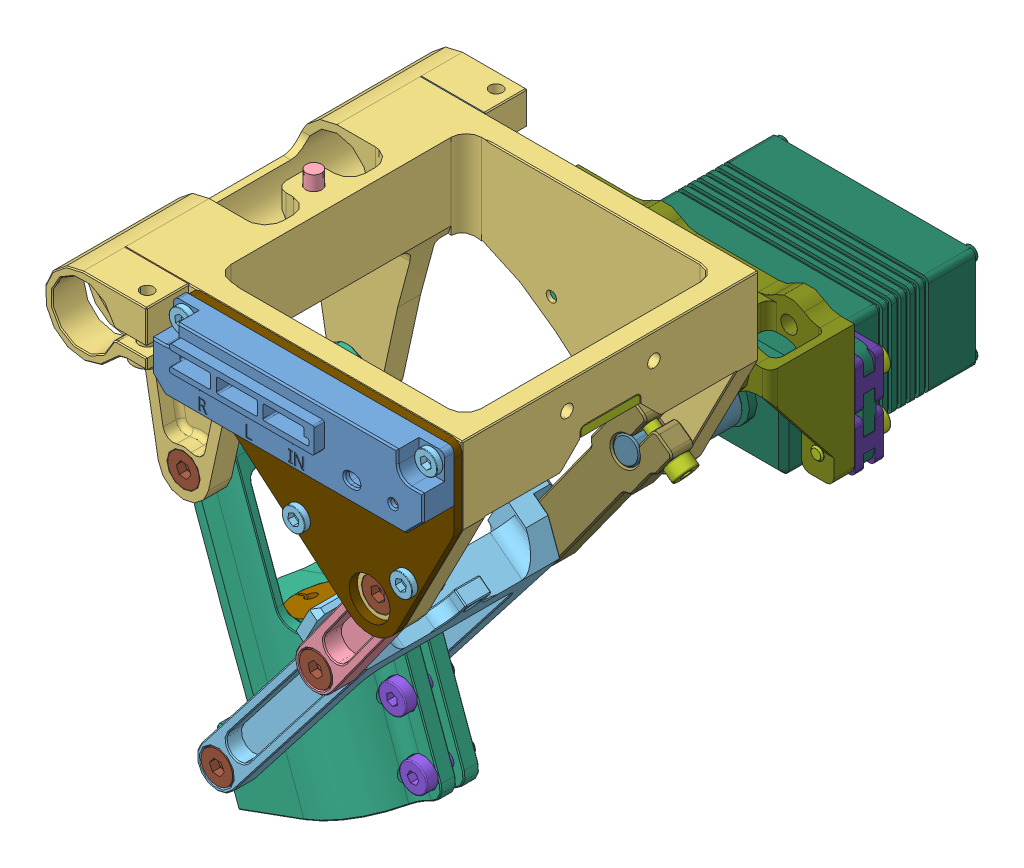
SolidWorks assembly M600 LANDING GEAR LH.sldasm, configuration 002 (file format 9000). Lengths in mm.
Overall size (80.24 101.74 117.34).
61 component instances, 27 part files, 43 mates.
Components (placement in the parent):
- M600 LANDING GEAR_4-01-1: M600 LANDING GEAR_4-01.sldasm [Default] at origin size (74.5 47.2 74.5)
  - 4-01_3-1: 4-01_3.sldprt [Default] at origin size (12.5 0.2 0.2)
  - 4-01_2-1: 4-01_2.sldprt [Default] at origin size (12.5 0.2 0.2)
  - 4-01-1: 4-01.sldprt [Default] at origin size (74.5 47.2 74.5)
- M600 LANDING GEAR_3-06-1: M600 LANDING GEAR_3-06.sldprt [Default] at (57 -19 19.5) x (-0.584535 -0.811369 0) z (0 0 1) size (37.5 8 4.5)
- M600 LANDING GEAR_3-04-1: M600 LANDING GEAR_3-04.sldprt [Default] at (9.8939 -74.8178 0) x (0 0 -1) z (0.789381 -0.613904 0) size (46 51.5 11.17)
- M600 LANDING GEAR_3-05-1: M600 LANDING GEAR_3-05.sldprt [Default] at (18.5766 -53.3114 0.373) x (0.939693 0.34202 0) z (0 0 1) size (32.5 60.6 28.21)
- M600 LANDING GEAR_3-07-1: M600 LANDING GEAR_3-07.sldprt [Default] at (71 6 0) x (0 0 1) z (0 -1 0) size (12 5 2)
- M600 LANDING GEAR_3-14-1: M600 LANDING GEAR_3-14.sldprt [Default] at (71 10.2 3.5) x (0.867382 0 -0.497644) z (0 -1 0) size (3 3 6)
- M600 LANDING GEAR_3-14-2: M600 LANDING GEAR_3-14.sldprt [Default] at (71 10.2 -3.5) x (0.785825 0 -0.618449) z (0 -1 0) size (3 3 6)
- M600 LANDING GEAR_3-08-1: M600 LANDING GEAR_3-08.sldprt [Default] at (9 -27 -17.5) x (0 0 1) z (-0.981491 0.19151 0) size (3.5 6.5 6.5)
- M600 LANDING GEAR_3-08-2: M600 LANDING GEAR_3-08.sldprt [Default] at (9 -27 17.5) x (0 0 -1) z (0.998134 0.061061 0) size (3.5 6.5 6.5)
- M600 LANDING GEAR_3-08-3: M600 LANDING GEAR_3-08.sldprt [Default] at (57 -19 27.5) x (0 0 -1) z (0.960479 -0.278353 0) size (3.5 6.5 6.5)
- M600 LANDING GEAR_3-09-1: M600 LANDING GEAR_3-09.sldprt [Default] at (9 -27 -17.5) x (0.906987 0.421159 0) z (-0.421159 0.906987 0) size (6.6 0.5 6.6)
- M600 LANDING GEAR_3-09-2: M600 LANDING GEAR_3-09.sldprt [Default] at (9 -27 18) x (0.906987 0.421159 0) z (-0.421159 0.906987 0) size (6.6 0.5 6.6)
- M600 LANDING GEAR_3-10-1: M600 LANDING GEAR_3-10.sldprt [Default] at (9 -27 19) x (0 0 -1) z (0.995455 -0.09523 0) size (9.5 6.2 6.2)
- M600 LANDING GEAR_3-10-2: M600 LANDING GEAR_3-10.sldprt [Default] at (9 -27 -19) x (0 0 1) z (-0.999018 -0.044316 0) size (9.5 6.2 6.2)
- M600 LANDING GEAR_3-08-4: M600 LANDING GEAR_3-08.sldprt [Default] at (15.507 -74.1159 -17.127) x (0 0 1) z (-0.999896 0.014394 0) size (3.5 6.5 6.5)
- M600 LANDING GEAR_3-08-5: M600 LANDING GEAR_3-08.sldprt [Default] at (15.507 -74.1159 17.873) x (0 0 -1) z (0.742965 -0.66933 0) size (3.5 6.5 6.5)
- M600 LANDING GEAR_3-09-3: M600 LANDING GEAR_3-09.sldprt [Default] at (15.507 -74.1159 -17.8) x (-0.546366 -0.837547 0) z (0.837547 -0.546366 0) size (6.6 0.5 6.6)
- M600 LANDING GEAR_3-09-4: M600 LANDING GEAR_3-09.sldprt [Default] at (15.507 -74.1159 18) x (0.937282 0.348572 0) z (-0.348572 0.937282 0) size (6.6 0.5 6.6)
- M600 LANDING GEAR_3-10-3: M600 LANDING GEAR_3-10.sldprt [Default] at (15.507 -74.1159 -19.3) x (0 0 1) z (0.57819 0.815902 0) size (9.5 6.2 6.2)
- M600 LANDING GEAR_3-10-4: M600 LANDING GEAR_3-10.sldprt [Default] at (15.507 -74.1159 19) x (0 0 -1) z (0.995455 -0.09523 0) size (9.5 6.2 6.2)
- M600 LANDING GEAR_3-08-6: M600 LANDING GEAR_3-08.sldprt [Default] at (39.7562 -42.9354 22.5) x (0 0 -1) z (0.996808 0.079833 0) size (3.5 6.5 6.5)
- M600 LANDING GEAR_3-09-5: M600 LANDING GEAR_3-09.sldprt [Default] at (39.7562 -42.9354 23) x (0.991476 -0.130291 0) z (0.130291 0.991476 0) size (6.6 0.5 6.6)
- M600 LANDING GEAR_3-10-5: M600 LANDING GEAR_3-10.sldprt [Default] at (39.7562 -42.9354 24) x (0 0 -1) z (-0.966454 0.256838 0) size (9.5 6.2 6.2)
- M600 LANDING GEAR_3-09-6: M600 LANDING GEAR_3-09.sldprt [Default] at (57 -19 28) x (0.983544 -0.180668 0) z (0.180668 0.983544 0) size (6.6 0.5 6.6)
- M600 LANDING GEAR_3-10-6: M600 LANDING GEAR_3-10.sldprt [Default] at (57 -19 29) x (0 0 -1) z (0.817178 0.576385 0) size (9.5 6.2 6.2)
- M600 LANDING GEAR_ROD-1: M600 LANDING GEAR_ROD.sldprt [Default] at (39.7562 -42.9354 -24.381) x (0.584535 0.811369 0) z (0 0 1) size (42 10.5 4.5)
- M600 LANDING GEAR_3-08-7: M600 LANDING GEAR_3-08.sldprt [Default] at (39.7562 -42.9354 -23.881) x (0 0 1) z (-0.802405 -0.59678 0) size (3.5 6.5 6.5)
- M600 LANDING GEAR_3-09-7: M600 LANDING GEAR_3-09.sldprt [Default] at (39.7562 -42.9354 -23.881) x (0.998747 -0.050038 0) z (0.050038 0.998747 0) size (6.6 0.5 6.6)
- M600 LANDING GEAR_3-10-7: M600 LANDING GEAR_3-10.sldprt [Default] at (39.7562 -42.9354 -25.381) x (0 0 1) z (-0.956226 0.292629 0) size (9.5 6.2 6.2)
- M600 LANDING GEAR_3-11-1: M600 LANDING GEAR_3-11.sldprt [Default] at (57 -19 -24) x (-0.450164 -0.892946 0) z (0 0 -1) size (8.5 8.5 2.1)
- M600 LANDING GEAR_3-11-2: M600 LANDING GEAR_3-11.sldprt [Default] at (57 -19 -29.5) x (0.845535 -0.53392 0) z (0 0 1) size (8.5 8.5 2.1)
- M600 LANDING GEAR_3-02-1: M600 LANDING GEAR_3-02.sldprt [Default] at (57 -19 -38) x (0.830396 -0.557174 0) z (0 0 1) size (9 9 18.5)
- M600 LANDING GEAR_3-16-1: M600 LANDING GEAR_3-16.sldprt [Default] at (67.21 -9 -78.7) x (-1 0 0) z (0 0 1) size (54 20 45)
- M600 LANDING GEAR_4-03-1: M600 LANDING GEAR_4-03.sldprt [Default] at (-26.79 -19 -47) x (-1 0 0) z (0 0 -1) size (54 27.85 18)
- M600 LANDING GEAR_3-17-1: M600 LANDING GEAR_3-17.sldprt [Default] at (71.085 -13.92 -49.8) size (6.5 9 5.6)
- M600 LANDING GEAR_3-17-2: M600 LANDING GEAR_3-17.sldprt [Default] at (71.085 -24.08 -49.8) size (6.5 9 5.6)
- M600 LANDING GEAR_3-17-3: M600 LANDING GEAR_3-17.sldprt [Default] at (23.335 -13.92 -49.8) x (-1 0 0) z (0 0 1) size (6.5 9 5.6)
- M600 LANDING GEAR_3-17-4: M600 LANDING GEAR_3-17.sldprt [Default] at (23.335 -24.08 -49.8) x (-1 0 0) z (0 0 1) size (6.5 9 5.6)
- M600 LANDING GEAR_4-04-1: M600 LANDING GEAR_4-04.sldprt [Default] at (33.5 -25 29) x (1 0 0) z (0 0 1) size (53 40 1.6)
- M600 LANDING GEAR_4-05-1: M600 LANDING GEAR_4-05.sldprt [Default] at (20.5 2 33.14) size (53 13.5 8.04)
- M600 LANDING GEAR_4-06-1: M600 LANDING GEAR_4-06.sldprt [Default] at (67.61 6 33.68) size (6.8 6.8 2)
- D600 BASE_3-12-1: D600 BASE_3-12.sldprt [Default] at (17 3.5 34.125) x (0.723429 0 0.690399) z (0 1 0) size (5.5 5.5 7.5)
- M600 LANDING GEAR_3-13-1: M600 LANDING GEAR_3-13.sldprt [Default] at (15.5 11.2 0) x (0.963016 0 0.269444) z (0 1 0) size (4.45 4.45 6.6)
- D600 BASE_3-12-2: D600 BASE_3-12.sldprt [Default] at (17 3.5 -34.125) x (0.723429 0 0.690399) z (0 1 0) size (5.5 5.5 7.5)
- M600 MODULE MOUNT_4-07-1: M600 MODULE MOUNT_4-07.sldprt [Default] at (71 12.5 26.24) x (-0.357263 -0.934004 0) z (0 0 1) size (4.45 4.45 7.4)
- M600 MODULE MOUNT_4-07-2: M600 MODULE MOUNT_4-07.sldprt [Default] at (64.2717 -12.5 24.4) x (0.422053 -0.906571 0) z (0 0 1) size (4.45 4.45 7.4)
- M600 MODULE MOUNT_4-07-3: M600 MODULE MOUNT_4-07.sldprt [Default] at (43.2717 -11.8832 24.4) x (0.422053 -0.906571 0) z (0 0 1) size (4.45 4.45 7.4)
- M600 MODULE MOUNT_4-07-4: M600 MODULE MOUNT_4-07.sldprt [Default] at (23 12.5 26.24) x (-0.357263 -0.934004 0) z (0 0 1) size (4.45 4.45 7.4)
- M600 LANDING GEAR_3-18-1: M600 LANDING GEAR_3-18.sldprt [Default] at (65.45 -5.15 -25.3) x (-0.655477 0.755215 0) z (0 0 -1) size (4.45 4.45 8.9)
- M600 LANDING GEAR_3-18-2: M600 LANDING GEAR_3-18.sldprt [Default] at (37.45 -5.15 -25.3) x (-0.655477 0.755215 0) z (0 0 -1) size (4.45 4.45 8.9)
- M600 LANDING GEAR_3-19-1: M600 LANDING GEAR_3-19.sldprt [Default] at (23.335 -13.92 -55.1) x (0.290722 0.956807 0) z (0.956807 -0.290722 0) size (4.5 12.5 4.5)
- M600 LANDING GEAR_3-19-2: M600 LANDING GEAR_3-19.sldprt [Default] at (23.335 -24.08 -55.1) x (0.290722 0.956807 0) z (0.956807 -0.290722 0) size (4.5 12.5 4.5)
- M600 LANDING GEAR_3-19-3: M600 LANDING GEAR_3-19.sldprt [Default] at (71.085 -13.92 -55.1) x (0.290722 0.956807 0) z (0.956807 -0.290722 0) size (4.5 12.5 4.5)
- M600 LANDING GEAR_3-19-4: M600 LANDING GEAR_3-19.sldprt [Default] at (71.085 -24.08 -55.1) x (0.290722 0.956807 0) z (0.956807 -0.290722 0) size (4.5 12.5 4.5)
- M600 LANDING GEAR_3-20-1: M600 LANDING GEAR_3-20.sldprt [Default] at (36.904 -58.3467 6.123) x (0.907289 -0.420507 0) z (0.420507 0.907289 0) size (5.5 11 5.5)
- M600 LANDING GEAR_3-20-2: M600 LANDING GEAR_3-20.sldprt [Default] at (41.0083 -69.623 6.123) x (0.995493 0.094836 0) z (-0.094836 0.995493 0) size (5.5 11 5.5)
- M600 LANDING GEAR_3-21-1: M600 LANDING GEAR_3-21.sldprt [Default] at (19.6026 -56.1305 0.373) x (0 0 1) z (-0.939693 -0.34202 0) size (15 6.58 17.55)
- M600 LANDING GEAR_3-19-5: M600 LANDING GEAR_3-19.sldprt [Default] at (66.7059 -19.2138 -21.631) x (0.566822 0.786782 -0.244311) z (0.142808 0.198226 0.969697) size (4.5 12.5 4.5)
Mates (geometry in assembly coordinates):
- Concentric1: concentric aligned: cylinder of M600 LANDING GEAR_4-01-1/4-01-1 through (9 -27 -18) axis (0 0 -1) radius 3.25; cylinder of M600 LANDING GEAR_3-05-1 through (9 -27 -13.627) axis (0 0 -1) radius 1.25
- Concentric2: concentric anti-aligned: cylinder of M600 LANDING GEAR_3-05-1 through (15.6694 -45.324 0.373) axis (0.34202 -0.939693 0) radius 6.5; cylinder of M600 LANDING GEAR_3-21-1 through (16.1495 -46.6431 0.373) axis (-0.34202 0.939693 0) radius 7.25
- Coincident1: coincident aligned: plane of M600 LANDING GEAR_3-05-1 through (5.4209 -58.0997 10.373) normal (-0.34202 0.939693 0); plane of M600 LANDING GEAR_3-21-1 through (18.5766 -53.3114 0.373) normal (-0.34202 0.939693 0)
- Concentric3: concentric aligned: cylinder of M600 LANDING GEAR_3-05-1 through (36.904 -58.3467 1.123) axis (0 0 1) radius 1.65; cylinder of M600 LANDING GEAR_3-20-1 through (36.904 -58.3467 -4.877) axis (0 0 1) radius 1.5
- Coincident2: coincident anti-aligned: plane of M600 LANDING GEAR_3-05-1 through (36.904 -58.3467 3.123) normal (0 0 1); plane of M600 LANDING GEAR_3-20-1 through (36.904 -58.3467 3.123) normal (0 0 -1)
- Concentric4: concentric aligned: cylinder of M600 LANDING GEAR_3-05-1 through (41.0083 -69.623 1.123) axis (0 0 1) radius 1.65; cylinder of M600 LANDING GEAR_3-20-2 through (41.0083 -69.623 -4.877) axis (0 0 1) radius 1.5
- Coincident3: coincident anti-aligned: plane of M600 LANDING GEAR_3-05-1 through (41.0083 -69.623 3.123) normal (0 0 1); plane of M600 LANDING GEAR_3-20-2 through (41.0083 -69.623 3.123) normal (0 0 -1)
- Concentric5: concentric aligned: cylinder of M600 LANDING GEAR_ROD-1 through (60.2149 -14.5375 -21.631) axis (0.811369 -0.584535 0) radius 1.25; cylinder of M600 LANDING GEAR_3-19-5 through (56.5638 -11.9071 -21.631) axis (0.811369 -0.584535 0) radius 1.25
- Coincident4: coincident anti-aligned: plane of M600 LANDING GEAR_ROD-1 through (44.2188 -46.1503 -24.381) normal (0.811369 -0.584535 0); plane of M600 LANDING GEAR_3-19-5 through (64.6775 -17.7524 -21.631) normal (-0.811369 0.584535 0)
- Concentric6: concentric aligned: cylinder of M600 LANDING GEAR_3-06-1 through (57 -19 24) axis (0 0 1) radius 1.25; cylinder of M600 LANDING GEAR_3-10-6 through (57 -19 29) axis (0 0 1) radius 1.5
- Coincident5: coincident anti-aligned: plane of M600 LANDING GEAR_3-06-1 through (57 -19 24) normal (0 0 1); plane of M600 LANDING GEAR_3-08-3 through (57.5567 -17.079 24) normal (0 0 -1)
- Coincident6: coincident anti-aligned: plane of M600 LANDING GEAR_3-04-1 through (16.2089 -79.729 19) normal (0 0 1); plane of M600 LANDING GEAR_3-08-6 through (39.5966 -40.9418 19) normal (0 0 -1)
- Concentric7: concentric aligned: cylinder of M600 LANDING GEAR_3-04-1 through (39.7562 -42.9354 19) axis (0 0 1) radius 1.25; cylinder of M600 LANDING GEAR_3-08-6 through (39.7562 -42.9354 22.5) axis (0 0 1) radius 2
- Concentric8: concentric aligned: cylinder of M600 LANDING GEAR_3-08-6 through (39.7562 -42.9354 22.5) axis (0 0 1) radius 2; cylinder of M600 LANDING GEAR_3-09-5 through (39.7562 -42.9354 22.5) axis (0 0 1) radius 2
- Coincident7: coincident anti-aligned: plane of M600 LANDING GEAR_3-08-6 through (39.5327 -40.1443 22.5) normal (0 0 1); plane of M600 LANDING GEAR_3-09-5 through (39.7562 -42.9354 22.5) normal (0 0 -1)
- Concentric9: concentric aligned: cylinder of M600 LANDING GEAR_3-08-6 through (39.7562 -42.9354 22.5) axis (0 0 1) radius 2; cylinder of M600 LANDING GEAR_3-10-5 through (39.7562 -42.9354 24) axis (0 0 1) radius 2
- Coincident8: coincident anti-aligned: plane of M600 LANDING GEAR_3-09-5 through (39.7562 -42.9354 23) normal (0 0 1); plane of M600 LANDING GEAR_3-10-5 through (38.96 -45.9314 23) normal (0 0 -1)
- Concentric10: concentric aligned: cylinder of M600 LANDING GEAR_3-06-1 through (39.7562 -42.9354 19.5) axis (0 0 1) radius 2.8; cylinder of M600 LANDING GEAR_3-08-6 through (39.7562 -42.9354 22.5) axis (0 0 1) radius 2.8
- Coincident9: coincident anti-aligned: plane of M600 LANDING GEAR_3-06-1 through (57 -19 19.5) normal (0 0 -1); plane of M600 LANDING GEAR_3-08-6 through (39.4968 -39.6957 19.5) normal (0 0 1)
- Concentric11: concentric aligned: cylinder of M600 LANDING GEAR_3-04-1 through (39.7562 -42.9354 -18.2) axis (0 0 -1) radius 2; cylinder of M600 LANDING GEAR_3-10-7 through (39.7562 -42.9354 -25.381) axis (0 0 -1) radius 1.5
- Concentric12: concentric aligned: cylinder of M600 LANDING GEAR_3-08-7 through (39.7562 -42.9354 -23.881) axis (0 0 -1) radius 2; cylinder of M600 LANDING GEAR_3-10-7 through (39.7562 -42.9354 -25.381) axis (0 0 -1) radius 2
- Concentric13: concentric anti-aligned: cylinder of M600 LANDING GEAR_3-09-7 through (39.7562 -42.9354 -24.381) axis (0 0 1) radius 3.3; cylinder of M600 LANDING GEAR_3-10-7 through (39.7562 -42.9354 -25.381) axis (0 0 -1) radius 2
- Coincident11: coincident anti-aligned: plane of M600 LANDING GEAR_3-08-7 through (38.0852 -40.6886 -23.881) normal (0 0 -1); plane of M600 LANDING GEAR_3-09-7 through (39.7562 -42.9354 -23.881) normal (0 0 1)
- Coincident12: coincident anti-aligned: plane of M600 LANDING GEAR_3-09-7 through (39.7562 -42.9354 -24.381) normal (0 0 -1); plane of M600 LANDING GEAR_3-10-7 through (40.6634 -39.9711 -24.381) normal (0 0 1)
- Concentric14: concentric anti-aligned: cylinder of M600 LANDING GEAR_ROD-1 through (39.7562 -42.9354 -24.381) axis (0 0 1) radius 2.8; cylinder of M600 LANDING GEAR_3-08-7 through (39.7562 -42.9354 -23.881) axis (0 0 -1) radius 2.8
- Coincident13: coincident anti-aligned: plane of M600 LANDING GEAR_ROD-1 through (63.112 -29.5657 -23.881) normal (0 0 -1); plane of M600 LANDING GEAR_3-09-7 through (39.7562 -42.9354 -23.881) normal (0 0 1)
- Coincident14: coincident aligned: plane of M600 LANDING GEAR_3-06-1 through (60.2455 -21.3381 24) normal (0.811369 -0.584535 0); plane of M600 LANDING GEAR_ROD-1 through (57.3228 -25.395 -19.381) normal (0.811369 -0.584535 0)
- Distance1: distance = 0.381 mm anti-aligned: plane of M600 LANDING GEAR_ROD-1 through (39.7562 -42.9354 -19.381) normal (0 0 1); plane of M600 LANDING GEAR_3-04-1 through (16.2089 -79.729 -19) normal (0 0 -1)
- Concentric15: concentric aligned: cylinder of M600 LANDING GEAR_3-05-1 through (15.507 -74.1159 14.373) axis (0 0 1) radius 1.25; cylinder of M600 LANDING GEAR_3-10-4 through (15.507 -74.1159 19) axis (0 0 1) radius 1.5
- Concentric16: concentric aligned: cylinder of M600 LANDING GEAR_3-08-5 through (15.507 -74.1159 17.873) axis (0 0 1) radius 2.8; cylinder of M600 LANDING GEAR_3-10-4 through (15.507 -74.1159 19) axis (0 0 1) radius 2
- Coincident16: coincident anti-aligned: plane of M600 LANDING GEAR_3-05-1 through (-7.2339 -23.331 14.373) normal (0 0 1); plane of M600 LANDING GEAR_3-08-5 through (16.8457 -72.63 14.373) normal (0 0 -1)
- Concentric17: concentric aligned: cylinder of M600 LANDING GEAR_3-08-5 through (15.507 -74.1159 17.873) axis (0 0 1) radius 2.8; cylinder of M600 LANDING GEAR_3-09-4 through (15.507 -74.1159 17.5) axis (0 0 1) radius 2
- Coincident17: coincident anti-aligned: plane of M600 LANDING GEAR_3-09-4 through (15.507 -74.1159 18) normal (0 0 1); plane of M600 LANDING GEAR_3-10-4 through (15.8022 -71.03 18) normal (0 0 -1)
- Concentric18: concentric aligned: cylinder of M600 LANDING GEAR_3-04-1 through (15.507 -74.1159 -19) axis (0 0 1) radius 2.8; cylinder of M600 LANDING GEAR_3-08-5 through (15.507 -74.1159 17.873) axis (0 0 1) radius 2.8
- Concentric19: concentric anti-aligned: cylinder of M600 LANDING GEAR_3-04-1 through (15.507 -74.1159 -19) axis (0 0 1) radius 2.8; cylinder of M600 LANDING GEAR_3-10-3 through (15.507 -74.1159 -19.3) axis (0 0 -1) radius 1.5
- Coincident18: coincident anti-aligned: plane of M600 LANDING GEAR_3-05-1 through (-7.2339 -23.331 -13.627) normal (0 0 -1); plane of M600 LANDING GEAR_3-08-4 through (15.5358 -72.1161 -13.627) normal (0 0 1)
- Concentric20: concentric anti-aligned: cylinder of M600 LANDING GEAR_3-04-1 through (15.507 -74.1159 -19) axis (0 0 1) radius 2.8; cylinder of M600 LANDING GEAR_3-08-4 through (15.507 -74.1159 -17.127) axis (0 0 -1) radius 2.8
- Concentric21: concentric anti-aligned: cylinder of M600 LANDING GEAR_3-08-4 through (15.507 -74.1159 -17.127) axis (0 0 -1) radius 2; cylinder of M600 LANDING GEAR_3-09-3 through (15.507 -74.1159 -18.3) axis (0 0 1) radius 2
- Coincident19: coincident anti-aligned: plane of M600 LANDING GEAR_3-04-1 through (15.507 -74.1159 -17.8) normal (0 0 -1); plane of M600 LANDING GEAR_3-09-3 through (15.507 -74.1159 -17.8) normal (0 0 1)
- Coincident20: coincident aligned: circle of M600 LANDING GEAR_3-09-3; plane of M600 LANDING GEAR_3-10-3 through (18.0363 -75.9083 -18.3) normal (0 0 1)
- Distance2: distance = 0.127 mm anti-aligned: plane of M600 LANDING GEAR_3-05-1 through (-7.2339 -23.331 14.373) normal (0 0 1); plane of M600 LANDING GEAR_4-01-1/4-01-1 through (0 -32 14.5) normal (0 0 -1)
- Parallel1: parallel anti-aligned: plane of M600 LANDING GEAR_4-01-1/4-01-1 through (0 15 -29) normal (0 1 0); plane of M600 LANDING GEAR_3-05-1
- Angle1: planar angle = 1.22173 rad anti-aligned: plane of M600 LANDING GEAR_3-05-1 through (-7.2339 -23.331 -13.627) normal (-0.939693 -0.34202 0); plane of M600 LANDING GEAR_4-01-1/4-01-1 through (0 15 -29) normal (0 1 0)
